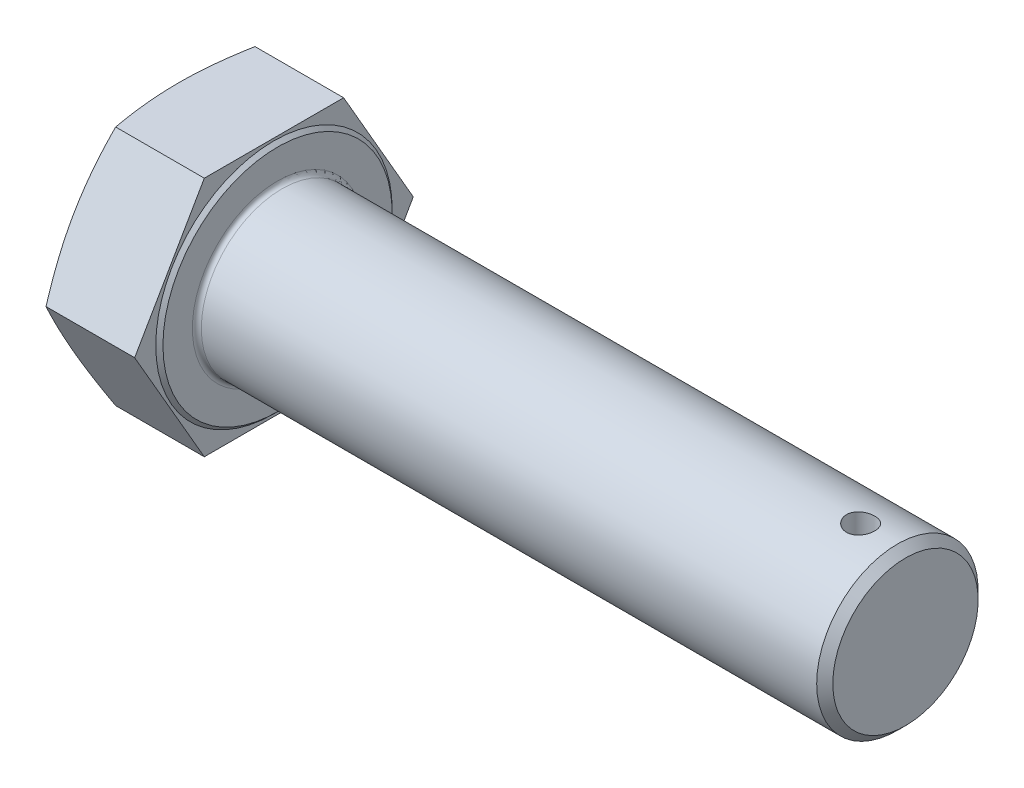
from build123d import *

# Parameters (mm, degrees)
BASEHEAD_DEPTH  = 22.08
SKETCH5_R       = 18
BASEBODY_DEPTH  = 140
CHAMFER1_SIZE   = 1.8
HOLE_DEPTH      = 168.207505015
HOLE_DEPTH_BACK = 168.207505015
SKETCH6_R       = 3.15
HEADFILLET_R    = 1


with BuildPart() as part:
    # Sketch2 → BaseHead (new body)
    with BuildSketch(Plane(origin=(0, 0, 0), x_dir=(0, 0, -1), z_dir=(1, 0, 0))):
        Polygon((31.061444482, 0), (15.530722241, 26.9), (-15.530722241, 26.9), (-31.061444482, 0), (-15.530722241, -26.9), (15.530722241, -26.9), align=None)
    extrude(amount=BASEHEAD_DEPTH)

    # Sketch3 → BearingFace (revolve, cut)
    with BuildSketch(Plane(origin=(0, 0, 0), x_dir=(1, 0, 0), z_dir=(0, 1, 0)), mode=Mode.PRIVATE) as bearingface_sk:
        Polygon((22.08, 31.061444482), (22.08, 25.555), (21.28, 26.355), (21.28, 31.061444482), align=None)
    revolve(bearingface_sk.sketch.rotate(Axis((-0.957090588, 0, 0), (1, 0, 0)), 180), axis=Axis((-0.957090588, 0, 0), (1, 0, 0)), mode=Mode.SUBTRACT)

    # Sketch4 → HeadChamfer (revolve, cut)
    with BuildSketch(Plane(origin=(0, 0, 0), x_dir=(1, 0, 0), z_dir=(0, 1, 0))):
        Polygon((0, 31.061444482), (1.514641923, 31.061444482), (0, 26.9), align=None)
    revolve(axis=Axis((-0.493528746, 0, 0), (1, 0, 0)), mode=Mode.SUBTRACT)

    # Sketch5 → BaseBody (add)
    with BuildSketch(Plane(origin=(22.08, 0, 0), x_dir=(0, 0, -1), z_dir=(1, 0, 0))):
        Circle(SKETCH5_R)
    extrude(amount=BASEBODY_DEPTH)

    # Chamfer1
    chamfer1_edges = [part.edges().sort_by_distance(p)[0] for p in [
        (162.08, 0, 18),
    ]]
    chamfer(chamfer1_edges, length=CHAMFER1_SIZE)

    # Sketch6 → Hole (cut, two sides: drawn at the far end of the back side and taken through both)
    with BuildSketch(Plane(origin=(0, 0, 0), x_dir=(1, 0, 0), z_dir=(0, 1, 0)).offset(-HOLE_DEPTH_BACK)):
        with Locations(Location((152.08, 0, 0), (0, 0, 270))):
            Circle(SKETCH6_R)
    extrude(amount=HOLE_DEPTH + HOLE_DEPTH_BACK, mode=Mode.SUBTRACT)

    # HeadFillet
    headfillet_edges = [part.edges().sort_by_distance(p)[0] for p in [
        (22.08, 0, 18),
    ]]
    fillet(headfillet_edges, radius=HEADFILLET_R)


solid = part.part
